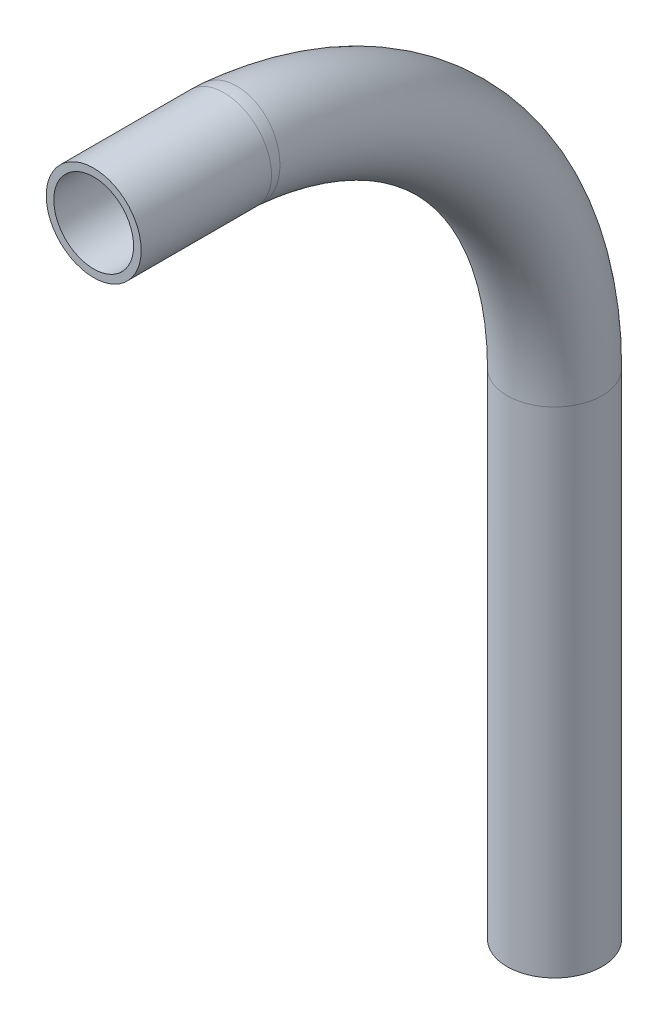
ISO-10303-21;
HEADER;
FILE_DESCRIPTION(('STEP AP214'),'2;1');
FILE_NAME('part.step','',(''),(''),'','','');
FILE_SCHEMA(('AUTOMOTIVE_DESIGN { 1 0 10303 214 1 1 1 1 }'));
ENDSEC;
DATA;
#1=APPLICATION_CONTEXT('core data for automotive mechanical design processes');
#2=APPLICATION_PROTOCOL_DEFINITION('international standard','automotive_design',2000,#1);
#3=PRODUCT_CONTEXT('',#1,'mechanical');
#4=PRODUCT('Part','Part','',(#3));
#5=PRODUCT_RELATED_PRODUCT_CATEGORY('part','',(#4));
#6=PRODUCT_DEFINITION_FORMATION('','',#4);
#7=PRODUCT_DEFINITION_CONTEXT('part definition',#1,'design');
#8=PRODUCT_DEFINITION('design','',#6,#7);
#9=PRODUCT_DEFINITION_SHAPE('','',#8);
#10=(LENGTH_UNIT() NAMED_UNIT(*) SI_UNIT(.MILLI.,.METRE.));
#11=(NAMED_UNIT(*) PLANE_ANGLE_UNIT() SI_UNIT($,.RADIAN.));
#12=(NAMED_UNIT(*) SI_UNIT($,.STERADIAN.) SOLID_ANGLE_UNIT());
#13=UNCERTAINTY_MEASURE_WITH_UNIT(LENGTH_MEASURE(1.E-05),#10,'distance_accuracy_value','');
#14=(GEOMETRIC_REPRESENTATION_CONTEXT(3) GLOBAL_UNCERTAINTY_ASSIGNED_CONTEXT((#13)) GLOBAL_UNIT_ASSIGNED_CONTEXT((#10,
#11,#12)) REPRESENTATION_CONTEXT('',''));
#15=CARTESIAN_POINT('',(0.,0.,0.));
#16=DIRECTION('',(0.,0.,1.));
#17=DIRECTION('',(1.,0.,0.));
#18=AXIS2_PLACEMENT_3D('',#15,#16,#17);
#19=CARTESIAN_POINT('',(0.,279.221524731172,120.110375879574));
#20=DIRECTION('',(1.,0.,0.));
#21=DIRECTION('',(0.,0.,-1.));
#22=AXIS2_PLACEMENT_3D('',#19,#20,#21);
#23=TOROIDAL_SURFACE('',#22,30.,14.5);
#24=CARTESIAN_POINT('',(0.,309.221524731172,120.110375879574));
#25=DIRECTION('',(0.,0.,1.));
#26=DIRECTION('',(1.,0.,0.));
#27=AXIS2_PLACEMENT_3D('',#24,#25,#26);
#28=CIRCLE('',#27,14.5);
#29=CARTESIAN_POINT('',(14.5,309.221524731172,120.110375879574));
#30=VERTEX_POINT('',#29);
#31=EDGE_CURVE('E74',#30,#30,#28,.T.);
#32=ORIENTED_EDGE('',*,*,#31,.T.);
#33=EDGE_LOOP('',(#32));
#34=FACE_BOUND('',#33,.T.);
#35=CARTESIAN_POINT('',(0.,309.074457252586,117.143488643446));
#36=DIRECTION('',(0.,0.0988962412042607,0.995097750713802));
#37=DIRECTION('',(0.,0.995097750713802,-0.0988962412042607));
#38=AXIS2_PLACEMENT_3D('',#35,#36,#37);
#39=CIRCLE('',#38,14.5);
#40=CARTESIAN_POINT('',(0.,323.503374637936,115.709493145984));
#41=VERTEX_POINT('',#40);
#42=EDGE_CURVE('E76',#41,#41,#39,.F.);
#43=ORIENTED_EDGE('',*,*,#42,.T.);
#44=EDGE_LOOP('',(#43));
#45=FACE_BOUND('',#44,.T.);
#46=ADVANCED_FACE('F15',(#34,#45),#23,.F.);
#47=CARTESIAN_POINT('',(0.,179.711749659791,130.));
#48=DIRECTION('',(1.,0.,0.));
#49=DIRECTION('',(0.,0.,-1.));
#50=AXIS2_PLACEMENT_3D('',#47,#48,#49);
#51=TOROIDAL_SURFACE('',#50,130.,14.5);
#52=ORIENTED_EDGE('',*,*,#42,.F.);
#53=EDGE_LOOP('',(#52));
#54=FACE_BOUND('',#53,.T.);
#55=CARTESIAN_POINT('',(0.,179.711749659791,0.));
#56=DIRECTION('',(0.,1.,0.));
#57=DIRECTION('',(0.,0.,1.));
#58=AXIS2_PLACEMENT_3D('',#55,#56,#57);
#59=CIRCLE('',#58,14.5);
#60=CARTESIAN_POINT('',(0.,179.711749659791,14.5));
#61=VERTEX_POINT('',#60);
#62=EDGE_CURVE('E72',#61,#61,#59,.F.);
#63=ORIENTED_EDGE('',*,*,#62,.T.);
#64=EDGE_LOOP('',(#63));
#65=FACE_BOUND('',#64,.T.);
#66=ADVANCED_FACE('F64',(#54,#65),#51,.F.);
#67=CARTESIAN_POINT('',(0.,309.221524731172,120.110375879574));
#68=DIRECTION('',(0.,0.,1.));
#69=DIRECTION('',(1.,0.,0.));
#70=AXIS2_PLACEMENT_3D('',#67,#68,#69);
#71=CYLINDRICAL_SURFACE('',#70,14.5);
#72=ORIENTED_EDGE('',*,*,#31,.F.);
#73=EDGE_LOOP('',(#72));
#74=FACE_BOUND('',#73,.T.);
#75=CARTESIAN_POINT('',(0.,309.221524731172,167.505177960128));
#76=DIRECTION('',(0.,0.,1.));
#77=DIRECTION('',(1.,0.,0.));
#78=AXIS2_PLACEMENT_3D('',#75,#76,#77);
#79=CIRCLE('',#78,14.5);
#80=CARTESIAN_POINT('',(14.5,309.221524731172,167.505177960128));
#81=VERTEX_POINT('',#80);
#82=EDGE_CURVE('E19',#81,#81,#79,.F.);
#83=ORIENTED_EDGE('',*,*,#82,.F.);
#84=EDGE_LOOP('',(#83));
#85=FACE_BOUND('',#84,.T.);
#86=ADVANCED_FACE('F61',(#74,#85),#71,.F.);
#87=CARTESIAN_POINT('',(0.,0.,0.));
#88=DIRECTION('',(0.,1.,0.));
#89=DIRECTION('',(0.,0.,1.));
#90=AXIS2_PLACEMENT_3D('',#87,#88,#89);
#91=CYLINDRICAL_SURFACE('',#90,14.5);
#92=ORIENTED_EDGE('',*,*,#62,.F.);
#93=EDGE_LOOP('',(#92));
#94=FACE_BOUND('',#93,.T.);
#95=CARTESIAN_POINT('',(0.,0.,0.));
#96=DIRECTION('',(0.,1.,0.));
#97=DIRECTION('',(0.,0.,1.));
#98=AXIS2_PLACEMENT_3D('',#95,#96,#97);
#99=CIRCLE('',#98,14.5);
#100=CARTESIAN_POINT('',(0.,0.,14.5));
#101=VERTEX_POINT('',#100);
#102=EDGE_CURVE('E86',#101,#101,#99,.F.);
#103=ORIENTED_EDGE('',*,*,#102,.T.);
#104=EDGE_LOOP('',(#103));
#105=FACE_BOUND('',#104,.T.);
#106=ADVANCED_FACE('F57',(#94,#105),#91,.F.);
#107=CARTESIAN_POINT('',(0.,309.221524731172,167.505177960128));
#108=DIRECTION('',(0.,0.,1.));
#109=DIRECTION('',(1.,0.,0.));
#110=AXIS2_PLACEMENT_3D('',#107,#108,#109);
#111=PLANE('',#110);
#112=CARTESIAN_POINT('',(0.,309.221524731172,167.505177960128));
#113=DIRECTION('',(0.,0.,1.));
#114=DIRECTION('',(1.,0.,0.));
#115=AXIS2_PLACEMENT_3D('',#112,#113,#114);
#116=CIRCLE('',#115,17.25);
#117=CARTESIAN_POINT('',(17.25,309.221524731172,167.505177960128));
#118=VERTEX_POINT('',#117);
#119=EDGE_CURVE('E84',#118,#118,#116,.F.);
#120=ORIENTED_EDGE('',*,*,#119,.F.);
#121=EDGE_LOOP('',(#120));
#122=FACE_BOUND('',#121,.T.);
#123=ORIENTED_EDGE('',*,*,#82,.T.);
#124=EDGE_LOOP('',(#123));
#125=FACE_BOUND('',#124,.T.);
#126=ADVANCED_FACE('F53',(#122,#125),#111,.T.);
#127=CARTESIAN_POINT('',(0.,0.,0.));
#128=DIRECTION('',(0.,1.,0.));
#129=DIRECTION('',(0.,0.,1.));
#130=AXIS2_PLACEMENT_3D('',#127,#128,#129);
#131=PLANE('',#130);
#132=ORIENTED_EDGE('',*,*,#102,.F.);
#133=EDGE_LOOP('',(#132));
#134=FACE_BOUND('',#133,.T.);
#135=CARTESIAN_POINT('',(0.,0.,0.));
#136=DIRECTION('',(0.,1.,0.));
#137=DIRECTION('',(0.,0.,1.));
#138=AXIS2_PLACEMENT_3D('',#135,#136,#137);
#139=CIRCLE('',#138,17.25);
#140=CARTESIAN_POINT('',(0.,0.,17.25));
#141=VERTEX_POINT('',#140);
#142=EDGE_CURVE('E81',#141,#141,#139,.T.);
#143=ORIENTED_EDGE('',*,*,#142,.F.);
#144=EDGE_LOOP('',(#143));
#145=FACE_BOUND('',#144,.T.);
#146=ADVANCED_FACE('F49',(#134,#145),#131,.F.);
#147=CARTESIAN_POINT('',(0.,309.221524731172,120.110375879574));
#148=DIRECTION('',(0.,0.,1.));
#149=DIRECTION('',(1.,0.,0.));
#150=AXIS2_PLACEMENT_3D('',#147,#148,#149);
#151=CYLINDRICAL_SURFACE('',#150,17.25);
#152=ORIENTED_EDGE('',*,*,#119,.T.);
#153=EDGE_LOOP('',(#152));
#154=FACE_BOUND('',#153,.T.);
#155=CARTESIAN_POINT('',(0.,309.221524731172,120.110375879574));
#156=DIRECTION('',(0.,0.,1.));
#157=DIRECTION('',(0.,1.,0.));
#158=AXIS2_PLACEMENT_3D('',#155,#156,#157);
#159=CIRCLE('',#158,17.25);
#160=CARTESIAN_POINT('',(0.,326.471524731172,120.110375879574));
#161=VERTEX_POINT('',#160);
#162=EDGE_CURVE('E28',#161,#161,#159,.F.);
#163=ORIENTED_EDGE('',*,*,#162,.F.);
#164=EDGE_LOOP('',(#163));
#165=FACE_BOUND('',#164,.T.);
#166=ADVANCED_FACE('F45',(#154,#165),#151,.T.);
#167=CARTESIAN_POINT('',(0.,0.,0.));
#168=DIRECTION('',(0.,1.,0.));
#169=DIRECTION('',(0.,0.,1.));
#170=AXIS2_PLACEMENT_3D('',#167,#168,#169);
#171=CYLINDRICAL_SURFACE('',#170,17.25);
#172=ORIENTED_EDGE('',*,*,#142,.T.);
#173=EDGE_LOOP('',(#172));
#174=FACE_BOUND('',#173,.T.);
#175=CARTESIAN_POINT('',(0.,179.711749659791,0.));
#176=DIRECTION('',(0.,1.,0.));
#177=DIRECTION('',(0.,0.,-1.));
#178=AXIS2_PLACEMENT_3D('',#175,#176,#177);
#179=CIRCLE('',#178,17.25);
#180=CARTESIAN_POINT('',(0.,179.711749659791,-17.25));
#181=VERTEX_POINT('',#180);
#182=EDGE_CURVE('E23',#181,#181,#179,.T.);
#183=ORIENTED_EDGE('',*,*,#182,.F.);
#184=EDGE_LOOP('',(#183));
#185=FACE_BOUND('',#184,.T.);
#186=ADVANCED_FACE('F41',(#174,#185),#171,.T.);
#187=CARTESIAN_POINT('',(0.,279.221524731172,120.110375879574));
#188=DIRECTION('',(1.,0.,0.));
#189=DIRECTION('',(0.,0.,-1.));
#190=AXIS2_PLACEMENT_3D('',#187,#188,#189);
#191=TOROIDAL_SURFACE('',#190,30.,17.25);
#192=CARTESIAN_POINT('',(0.,309.074457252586,117.143488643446));
#193=DIRECTION('',(0.,0.0988962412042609,0.995097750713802));
#194=DIRECTION('',(0.,0.995097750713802,-0.0988962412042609));
#195=AXIS2_PLACEMENT_3D('',#192,#193,#194);
#196=CIRCLE('',#195,17.25);
#197=CARTESIAN_POINT('',(0.,326.239893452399,115.437528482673));
#198=VERTEX_POINT('',#197);
#199=EDGE_CURVE('E10',#198,#198,#196,.F.);
#200=ORIENTED_EDGE('',*,*,#199,.F.);
#201=EDGE_LOOP('',(#200));
#202=FACE_BOUND('',#201,.T.);
#203=ORIENTED_EDGE('',*,*,#162,.T.);
#204=EDGE_LOOP('',(#203));
#205=FACE_BOUND('',#204,.T.);
#206=ADVANCED_FACE('F36',(#202,#205),#191,.T.);
#207=CARTESIAN_POINT('',(0.,179.711749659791,130.));
#208=DIRECTION('',(1.,0.,0.));
#209=DIRECTION('',(0.,0.,-1.));
#210=AXIS2_PLACEMENT_3D('',#207,#208,#209);
#211=TOROIDAL_SURFACE('',#210,130.,17.25);
#212=ORIENTED_EDGE('',*,*,#182,.T.);
#213=EDGE_LOOP('',(#212));
#214=FACE_BOUND('',#213,.T.);
#215=ORIENTED_EDGE('',*,*,#199,.T.);
#216=EDGE_LOOP('',(#215));
#217=FACE_BOUND('',#216,.T.);
#218=ADVANCED_FACE('F40',(#214,#217),#211,.T.);
#219=CLOSED_SHELL('',(#46,#66,#86,#106,#126,#146,#166,#186,#206,#218));
#220=MANIFOLD_SOLID_BREP('B1',#219);
#221=ADVANCED_BREP_SHAPE_REPRESENTATION('',(#18,#220),#14);
#222=SHAPE_DEFINITION_REPRESENTATION(#9,#221);
ENDSEC;
END-ISO-10303-21;
